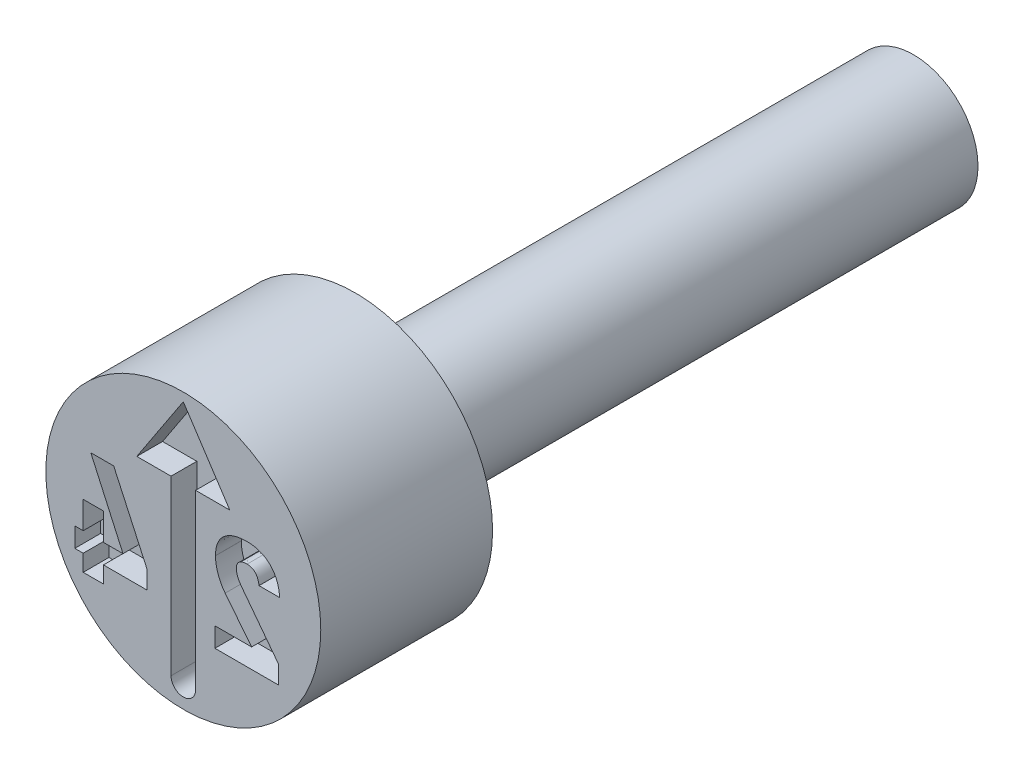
from build123d import *

# Parameters (mm, degrees)
CUT_EXTRUDE4_DEPTH = 0.6
SKETCH4_W          = 0.471265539
SKETCH4_H          = 1.471876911
CUT_EXTRUDE5_DEPTH = 0.6


with BuildPart() as part:
    # Sketch2 → Revolve1 (revolve)
    with BuildSketch(Plane(origin=(0, 0, 0), x_dir=(0, 0, -1), z_dir=(1, 0, 0)), mode=Mode.PRIVATE) as revolve1_sk:
        Polygon((0, 3.2), (0, 0), (17, 0), (17, 1.5), (4, 1.5), (4, 3.2), align=None)
    revolve(revolve1_sk.sketch.rotate(Axis((0, 0, -0.403888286), (0, 0, -1)), 90), axis=Axis((0, 0, -0.403888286), (0, 0, -1)))

    # Sketch3 → Cut-Extrude4 (cut)
    with BuildSketch(Plane.XY):
        with BuildLine():
            Line((0.285709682, 1.359527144), (0.285709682, -2.664242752))
            ThreePointArc((0.285709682, -2.664242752), (0, -2.949952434), (-0.285709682, -2.664242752))
            Line((-0.285709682, -2.664242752), (-0.285709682, 1.359527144))
            Line((-0.285709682, 1.359527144), (-1.082876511, 1.359527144))
            Line((-1.082876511, 1.359527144), (0, 3.00317302))
            Line((0, 3.00317302), (1.082876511, 1.359527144))
            Line((1.082876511, 1.359527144), (0.285709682, 1.359527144))
        make_face()
    extrude(amount=-CUT_EXTRUDE4_DEPTH, mode=Mode.SUBTRACT)

    # Sketch4 → Cut-Extrude5 (cut)
    with BuildSketch(Plane.XY):
        with BuildLine():
            Line((2.214041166, -1.1750968), (1.356083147, -0.047116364))
            add(Edge.make_bspline(
                [(1.356083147, -0.047116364), (1.338089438, -0.022151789), (1.302961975, 0.026584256), (1.271533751, 0.093804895), (1.251568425, 0.14651286), (1.242338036, 0.184746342), (1.235504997, 0.221306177), (1.23470844, 0.245293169), (1.234318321, 0.257040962)],
                knots=[0, 0, 0, 0, 1.660423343, 3.241491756, 3.993801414, 4.704207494, 5.365376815, 6, 6, 6, 6], degree=3))
            Line((1.234318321, 0.257040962), (1.234318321, 0.260607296))
            add(Edge.make_bspline(
                [(1.234318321, 0.260607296), (1.235002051, 0.276660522), (1.236305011, 0.307252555), (1.248883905, 0.35029241), (1.269684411, 0.387510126), (1.298820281, 0.418709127), (1.335881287, 0.442687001), (1.379597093, 0.460202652), (1.430200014, 0.470113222), (1.466086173, 0.471375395), (1.48498064, 0.472039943)],
                knots=[0, 0, 0, 0, 1.033361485, 1.969238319, 2.861873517, 3.760870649, 4.693536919, 5.686153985, 6.781734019, 8, 8, 8, 8], degree=3))
            add(Edge.make_bspline(
                [(1.48498064, 0.472039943), (1.503586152, 0.471254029), (1.539693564, 0.46972882), (1.591056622, 0.455195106), (1.636684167, 0.430521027), (1.676182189, 0.396420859), (1.709324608, 0.353522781), (1.733753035, 0.301844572), (1.753425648, 0.243110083), (1.759134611, 0.200481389), (1.762135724, 0.178072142)],
                knots=[0, 0, 0, 0, 0.993701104, 1.928459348, 2.826878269, 3.748294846, 4.700551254, 5.70417143, 6.793118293, 8, 8, 8, 8], degree=3))
            Line((1.762135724, 0.178072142), (1.762135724, 0.176034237))
            Line((1.762135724, 0.176034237), (2.245119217, 0.176034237))
            Line((2.245119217, 0.176034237), (2.245119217, 0.178072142))
            add(Edge.make_bspline(
                [(2.245119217, 0.178072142), (2.241658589, 0.215709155), (2.234917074, 0.289028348), (2.211994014, 0.39446722), (2.178130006, 0.491486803), (2.134864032, 0.580354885), (2.081812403, 0.659949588), (2.020256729, 0.730249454), (1.949515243, 0.789888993), (1.870813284, 0.839447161), (1.784494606, 0.878231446), (1.691614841, 0.906490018), (1.592034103, 0.92278077), (1.52359035, 0.924898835), (1.488546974, 0.925983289)],
                knots=[0, 0, 0, 0, 1.143950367, 2.228484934, 3.258162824, 4.249580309, 5.213917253, 6.146796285, 7.070112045, 8.006232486, 8.954636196, 9.927630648, 10.9389416, 12, 12, 12, 12], degree=3))
            add(Edge.make_bspline(
                [(1.488546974, 0.925983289), (1.45096879, 0.925197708), (1.378238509, 0.923677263), (1.273511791, 0.909364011), (1.177213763, 0.885545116), (1.089586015, 0.852080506), (1.011203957, 0.809062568), (0.941704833, 0.758000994), (0.883050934, 0.69691357), (0.834262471, 0.627517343), (0.795802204, 0.550080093), (0.768868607, 0.464668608), (0.752374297, 0.371968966), (0.750343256, 0.307549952), (0.749296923, 0.274363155)],
                knots=[0, 0, 0, 0, 1.208591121, 2.339154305, 3.392741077, 4.394302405, 5.348037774, 6.261656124, 7.158186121, 8.060194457, 8.981460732, 9.928425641, 10.932785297, 12, 12, 12, 12], degree=3))
            Line((0.749296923, 0.274363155), (0.749296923, 0.27232525))
            add(Edge.make_bspline(
                [(0.749296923, 0.27232525), (0.749950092, 0.243928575), (0.751257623, 0.187083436), (0.7629191, 0.102158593), (0.781987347, 0.017724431), (0.80786039, -0.065923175), (0.840168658, -0.147387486), (0.878726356, -0.225370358), (0.922747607, -0.299672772), (0.957241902, -0.345624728), (0.974485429, -0.368595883)],
                knots=[0, 0, 0, 0, 0.985191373, 1.972179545, 2.968870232, 3.986806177, 5.007996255, 6.007036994, 7.003727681, 8, 8, 8, 8], degree=3))
            Line((0.974485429, -0.368595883), (1.589932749, -1.146056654))
            Line((1.589932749, -1.146056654), (0.735541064, -1.146056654))
            Line((0.735541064, -1.146056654), (0.735541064, -1.6))
            Line((0.735541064, -1.6), (2.214041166, -1.6))
            Line((2.214041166, -1.6), (2.214041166, -1.1750968))
        make_face()
        Polygon((-0.84978602, -0.783309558), (-1.620114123, 0.898471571), (-2.153535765, 0.898471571), (-1.403586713, -0.762421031), (-2.526472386, -0.762421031), (-2.526472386, -1.216364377), (-0.84978602, -1.216364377), align=None)
        with Locations((-2.094691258, -0.865589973)):
            Rectangle(SKETCH4_W, SKETCH4_H)
    extrude(amount=-CUT_EXTRUDE5_DEPTH, mode=Mode.SUBTRACT)


solid = part.part
